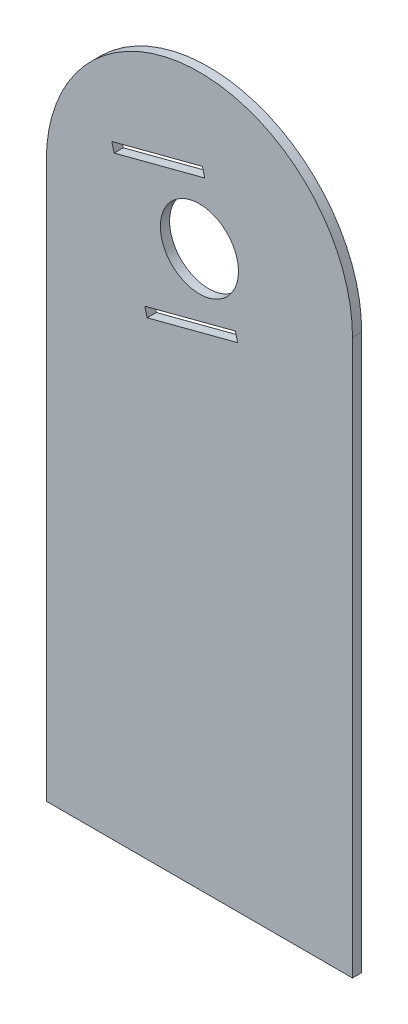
from build123d import *

# Parameters (mm, degrees)
SKETCH1_R           = 6.477
BOSS_EXTRUDE1_DEPTH = 1.524


with BuildPart() as part:
    # Sketch1 → Boss-Extrude1 (new body)
    with BuildSketch(Plane.XY):
        with BuildLine():
            Line((-34.05306863, -35.011654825), (-34.05306863, -127.07412464))
            Line((-34.05306863, -127.07412464), (-84.85306863, -127.07412464))
            Line((-84.85306863, -127.07412464), (-84.85306863, -35.011654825))
            ThreePointArc((-84.85306863, -35.011654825), (-59.45306863, -9.611654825), (-34.05306863, -35.011654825))
        make_face()
        with Locations(Location((-59.45306863, -35.011654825, 0), (0, 0, 180))):
            Circle(SKETCH1_R, mode=Mode.SUBTRACT)
        Polygon((-73.98823577, -26.847732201), (-73.602306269, -28.322057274), (-58.572284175, -24.387695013), (-58.958213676, -22.91336994), align=None, mode=Mode.SUBTRACT)
        Polygon((-53.093996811, -45.315808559), (-53.479926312, -43.841483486), (-68.509948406, -47.775845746), (-68.124018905, -49.250170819), align=None, mode=Mode.SUBTRACT)
    extrude(amount=BOSS_EXTRUDE1_DEPTH)


solid = part.part
